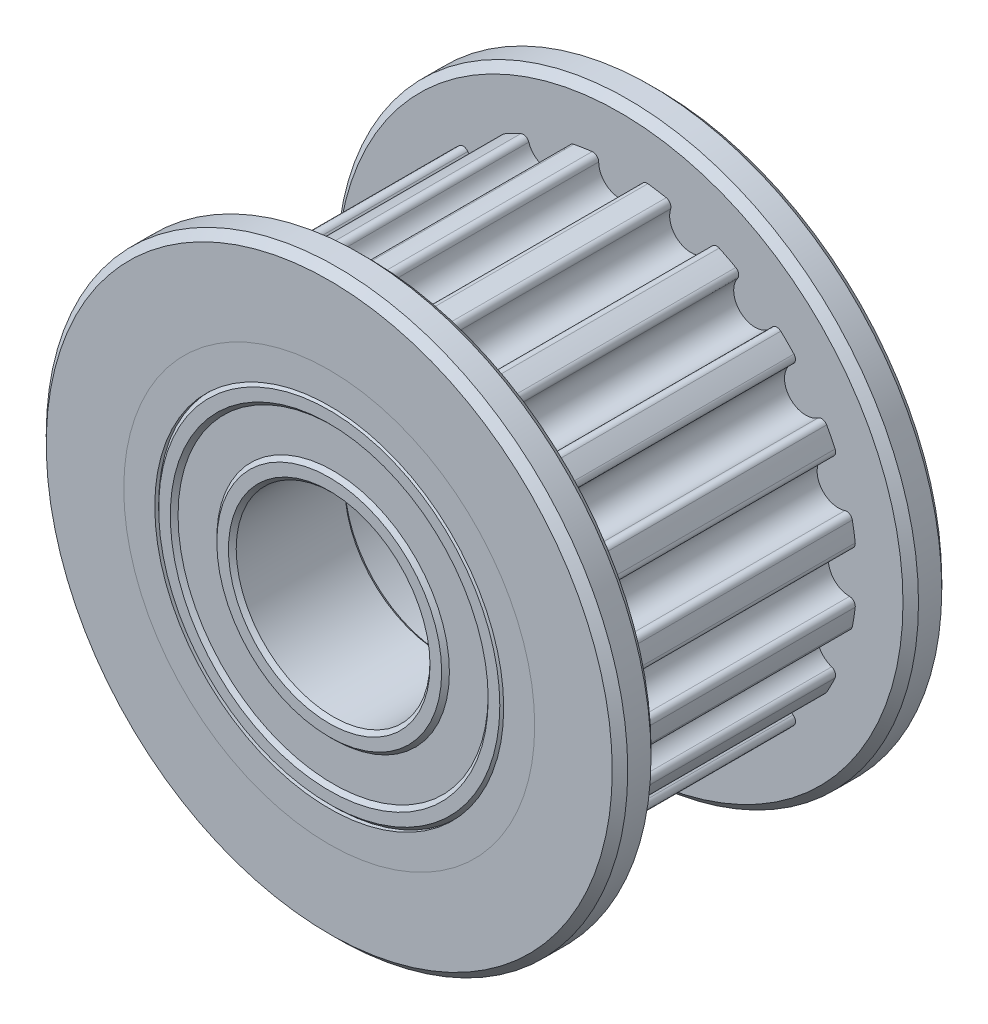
from build123d import *

# Parameters (mm, degrees)
SKICA1_R                  = 5.3
SKICA1_R_2                = 4
P_IDAT_VYSUNUT_M1_DEPTH   = 8.5
SKICA1_3_R                = 7.5
SKICA1_3_R_2              = 5.3
P_IDAT_VYSUNUT_M2_DEPTH   = 1
SKICA2_R                  = 4.75
P_IDAT_VYSUNUT_M5_DEPTH   = 6.5
SKICA4_R                  = 7.5
SKICA4_R_2                = 5.3
P_IDAT_VYSUNUT_M6_DEPTH   = 1
SKICA5_R                  = 4.5
ODEBRAT_VYSUNUT_M3_DEPTH  = 3
ODEBRAT_START             = -3
SKICA6_R                  = 4.5
ODEBRAT_VYSUNUT_M4_DEPTH  = 3
ZKOSEN_1_SIZE             = 0.2
ZKOSEN_2_SIZE             = 0.2
SKICA7_R                  = 4.5
SKICA7_R_2                = 4
P_IDAT_VYSUNUT_M7_DEPTH   = 3
SKICA7_R_3                = 3
SKICA7_R_4                = 2.5
P_IDAT_VYSUNUT_M7_2_DEPTH = 3
P_IDAT_START              = 0.1
SKICA7_3_R                = 4
SKICA7_3_R_2              = 3
P_IDAT_VYSUNUT_M8_DEPTH   = 2.8
ZKOSEN_3_SIZE             = 0.1
ZKOSEN_4_SIZE             = 0.1
SKICA8_R                  = 4.5
SKICA8_R_2                = 4
P_IDAT_VYSUNUT_M9_DEPTH   = 3
SKICA8_R_3                = 3
SKICA8_R_4                = 2.5
P_IDAT_VYSUNUT_M9_2_DEPTH = 3
SKICA8_3_R                = 4
SKICA8_3_R_2              = 3
P_IDAT_VYSUNUT_M10_DEPTH  = 2.8
ZKOSEN_5_SIZE             = 0.1
ZKOSEN_6_SIZE             = 0.1
ZKOSEN_7_SIZE             = 0.1
ZKOSEN_8_SIZE             = 0.1
ZKOSEN_10_SIZE            = 0.1
ZKOSEN_12_SIZE            = 0.1


with BuildPart() as part:
    # Skica1 → P_idat vysunut_m1 (new body)
    with BuildSketch(Plane.XY):
        Circle(SKICA1_R)
        Circle(SKICA1_R_2, mode=Mode.SUBTRACT)
    extrude(amount=P_IDAT_VYSUNUT_M1_DEPTH)

    # Skica5 → Odebrat vysunut_m3 (cut)
    with BuildSketch(Plane.XY.offset(8.5)):
        Circle(SKICA5_R)
    extrude(amount=-ODEBRAT_VYSUNUT_M3_DEPTH, mode=Mode.SUBTRACT)

    # Skica6 → Odebrat vysunut_m4 (cut)
    with BuildSketch(Plane(origin=(0, 0, 0), x_dir=(-1, 0, 0), z_dir=(0, 0, -1)).offset(ODEBRAT_START)):
        with Locations(Location((0, 0, 0), (0, 0, 180))):
            Circle(SKICA6_R)
    extrude(amount=ODEBRAT_VYSUNUT_M4_DEPTH, mode=Mode.SUBTRACT)


with BuildPart() as body_2:
    # Skica1_3 → P_idat vysunut_m2 (new body)
    with BuildSketch(Plane.XY):
        Circle(SKICA1_3_R)
        Circle(SKICA1_3_R_2, mode=Mode.SUBTRACT)
    extrude(amount=P_IDAT_VYSUNUT_M2_DEPTH)

    # Zkosen_1
    zkosen_1_edges = [body_2.edges().sort_by_distance(p)[0] for p in [
        (-7.5, 0, 1),
        (-7.5, 0, 0),
    ]]
    chamfer(zkosen_1_edges, length=ZKOSEN_1_SIZE)


with BuildPart() as body_3:
    # Skica2 → P_idat vysunut_m5 (new body)
    with BuildSketch(Plane.XY.offset(1)):
        with BuildLine():
            ThreePointArc((-5.920091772, -0.549978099), (-5.375, 0), (-5.920091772, 0.549978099))
            ThreePointArc((-5.920091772, 0.549978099), (-6.031318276, 0.60083033), (-6.067715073, 0.717588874))
            ThreePointArc((-6.067715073, 0.717588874), (-6.034775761, 0.955814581), (-5.992487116, 1.1925595))
            ThreePointArc((-5.992487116, 1.1925595), (-5.921791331, 1.292356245), (-5.800294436, 1.306348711))
            ThreePointArc((-5.800294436, 1.306348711), (-5.111928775, 1.660966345), (-5.460389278, 2.352469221))
            ThreePointArc((-5.460389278, 2.352469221), (-5.550457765, 2.435203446), (-5.548992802, 2.557494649))
            ThreePointArc((-5.548992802, 2.557494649), (-5.444049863, 2.773881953), (-5.330672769, 2.985971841))
            ThreePointArc((-5.330672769, 2.985971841), (-5.232598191, 3.059037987), (-5.112723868, 3.034801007))
            ThreePointArc((-5.112723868, 3.034801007), (-4.348466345, 3.159345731), (-4.466185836, 3.924684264))
            ThreePointArc((-4.466185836, 3.924684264), (-4.526279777, 4.031201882), (-4.487096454, 4.147055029))
            ThreePointArc((-4.487096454, 4.147055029), (-4.320422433, 4.320422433), (-4.147055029, 4.487096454))
            ThreePointArc((-4.147055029, 4.487096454), (-4.031201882, 4.526279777), (-3.924684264, 4.466185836))
            ThreePointArc((-3.924684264, 4.466185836), (-3.159345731, 4.348466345), (-3.034801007, 5.112723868))
            ThreePointArc((-3.034801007, 5.112723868), (-3.059037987, 5.232598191), (-2.985971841, 5.330672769))
            ThreePointArc((-2.985971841, 5.330672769), (-2.773881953, 5.444049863), (-2.557494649, 5.548992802))
            ThreePointArc((-2.557494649, 5.548992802), (-2.435203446, 5.550457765), (-2.352469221, 5.460389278))
            ThreePointArc((-2.352469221, 5.460389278), (-1.660966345, 5.111928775), (-1.306348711, 5.800294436))
            ThreePointArc((-1.306348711, 5.800294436), (-1.292356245, 5.921791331), (-1.1925595, 5.992487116))
            ThreePointArc((-1.1925595, 5.992487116), (-0.955814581, 6.034775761), (-0.717588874, 6.067715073))
            ThreePointArc((-0.717588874, 6.067715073), (-0.60083033, 6.031318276), (-0.549978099, 5.920091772))
            ThreePointArc((-0.549978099, 5.920091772), (0, 5.375), (0.549978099, 5.920091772))
            ThreePointArc((0.549978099, 5.920091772), (0.60083033, 6.031318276), (0.717588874, 6.067715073))
            ThreePointArc((0.717588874, 6.067715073), (0.955814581, 6.034775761), (1.1925595, 5.992487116))
            ThreePointArc((1.1925595, 5.992487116), (1.292356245, 5.921791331), (1.306348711, 5.800294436))
            ThreePointArc((1.306348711, 5.800294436), (1.660966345, 5.111928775), (2.352469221, 5.460389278))
            ThreePointArc((2.352469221, 5.460389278), (2.435203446, 5.550457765), (2.557494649, 5.548992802))
            ThreePointArc((2.557494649, 5.548992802), (2.773881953, 5.444049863), (2.985971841, 5.330672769))
            ThreePointArc((2.985971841, 5.330672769), (3.059037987, 5.232598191), (3.034801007, 5.112723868))
            ThreePointArc((3.034801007, 5.112723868), (3.159345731, 4.348466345), (3.924684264, 4.466185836))
            ThreePointArc((3.924684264, 4.466185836), (4.031201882, 4.526279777), (4.147055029, 4.487096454))
            ThreePointArc((4.147055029, 4.487096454), (4.320422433, 4.320422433), (4.487096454, 4.147055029))
            ThreePointArc((4.487096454, 4.147055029), (4.526279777, 4.031201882), (4.466185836, 3.924684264))
            ThreePointArc((4.466185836, 3.924684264), (4.348466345, 3.159345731), (5.112723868, 3.034801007))
            ThreePointArc((5.112723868, 3.034801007), (5.232598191, 3.059037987), (5.330672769, 2.985971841))
            ThreePointArc((5.330672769, 2.985971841), (5.444049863, 2.773881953), (5.548992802, 2.557494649))
            ThreePointArc((5.548992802, 2.557494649), (5.550457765, 2.435203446), (5.460389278, 2.352469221))
            ThreePointArc((5.460389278, 2.352469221), (5.111928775, 1.660966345), (5.800294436, 1.306348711))
            ThreePointArc((5.800294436, 1.306348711), (5.921791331, 1.292356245), (5.992487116, 1.1925595))
            ThreePointArc((5.992487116, 1.1925595), (6.034775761, 0.955814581), (6.067715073, 0.717588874))
            ThreePointArc((6.067715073, 0.717588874), (6.031318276, 0.60083033), (5.920091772, 0.549978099))
            ThreePointArc((5.920091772, 0.549978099), (5.375, 0), (5.920091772, -0.549978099))
            ThreePointArc((5.920091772, -0.549978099), (6.031318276, -0.60083033), (6.067715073, -0.717588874))
            ThreePointArc((6.067715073, -0.717588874), (6.034775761, -0.955814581), (5.992487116, -1.1925595))
            ThreePointArc((5.992487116, -1.1925595), (5.921791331, -1.292356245), (5.800294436, -1.306348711))
            ThreePointArc((5.800294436, -1.306348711), (5.111928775, -1.660966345), (5.460389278, -2.352469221))
            ThreePointArc((5.460389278, -2.352469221), (5.550457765, -2.435203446), (5.548992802, -2.557494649))
            ThreePointArc((5.548992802, -2.557494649), (5.444049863, -2.773881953), (5.330672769, -2.985971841))
            ThreePointArc((5.330672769, -2.985971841), (5.232598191, -3.059037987), (5.112723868, -3.034801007))
            ThreePointArc((5.112723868, -3.034801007), (4.348466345, -3.159345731), (4.466185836, -3.924684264))
            ThreePointArc((4.466185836, -3.924684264), (4.526279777, -4.031201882), (4.487096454, -4.147055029))
            ThreePointArc((4.487096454, -4.147055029), (4.320422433, -4.320422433), (4.147055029, -4.487096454))
            ThreePointArc((4.147055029, -4.487096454), (4.031201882, -4.526279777), (3.924684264, -4.466185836))
            ThreePointArc((3.924684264, -4.466185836), (3.159345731, -4.348466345), (3.034801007, -5.112723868))
            ThreePointArc((3.034801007, -5.112723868), (3.059037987, -5.232598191), (2.985971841, -5.330672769))
            ThreePointArc((2.985971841, -5.330672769), (2.773881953, -5.444049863), (2.557494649, -5.548992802))
            ThreePointArc((2.557494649, -5.548992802), (2.435203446, -5.550457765), (2.352469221, -5.460389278))
            ThreePointArc((2.352469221, -5.460389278), (1.660966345, -5.111928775), (1.306348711, -5.800294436))
            ThreePointArc((1.306348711, -5.800294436), (1.292356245, -5.921791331), (1.1925595, -5.992487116))
            ThreePointArc((1.1925595, -5.992487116), (0.955814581, -6.034775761), (0.717588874, -6.067715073))
            ThreePointArc((0.717588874, -6.067715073), (0.60083033, -6.031318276), (0.549978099, -5.920091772))
            ThreePointArc((0.549978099, -5.920091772), (0, -5.375), (-0.549978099, -5.920091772))
            ThreePointArc((-0.549978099, -5.920091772), (-0.60083033, -6.031318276), (-0.717588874, -6.067715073))
            ThreePointArc((-0.717588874, -6.067715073), (-0.955814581, -6.034775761), (-1.1925595, -5.992487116))
            ThreePointArc((-1.1925595, -5.992487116), (-1.292356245, -5.921791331), (-1.306348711, -5.800294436))
            ThreePointArc((-1.306348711, -5.800294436), (-1.660966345, -5.111928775), (-2.352469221, -5.460389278))
            ThreePointArc((-2.352469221, -5.460389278), (-2.435203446, -5.550457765), (-2.557494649, -5.548992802))
            ThreePointArc((-2.557494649, -5.548992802), (-2.773881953, -5.444049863), (-2.985971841, -5.330672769))
            ThreePointArc((-2.985971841, -5.330672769), (-3.059037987, -5.232598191), (-3.034801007, -5.112723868))
            ThreePointArc((-3.034801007, -5.112723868), (-3.159345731, -4.348466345), (-3.924684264, -4.466185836))
            ThreePointArc((-3.924684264, -4.466185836), (-4.031201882, -4.526279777), (-4.147055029, -4.487096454))
            ThreePointArc((-4.147055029, -4.487096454), (-4.320422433, -4.320422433), (-4.487096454, -4.147055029))
            ThreePointArc((-4.487096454, -4.147055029), (-4.526279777, -4.031201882), (-4.466185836, -3.924684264))
            ThreePointArc((-4.466185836, -3.924684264), (-4.348466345, -3.159345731), (-5.112723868, -3.034801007))
            ThreePointArc((-5.112723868, -3.034801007), (-5.232598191, -3.059037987), (-5.330672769, -2.985971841))
            ThreePointArc((-5.330672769, -2.985971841), (-5.444049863, -2.773881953), (-5.548992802, -2.557494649))
            ThreePointArc((-5.548992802, -2.557494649), (-5.550457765, -2.435203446), (-5.460389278, -2.352469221))
            ThreePointArc((-5.460389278, -2.352469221), (-5.111928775, -1.660966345), (-5.800294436, -1.306348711))
            ThreePointArc((-5.800294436, -1.306348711), (-5.921791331, -1.292356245), (-5.992487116, -1.1925595))
            ThreePointArc((-5.992487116, -1.1925595), (-6.034775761, -0.955814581), (-6.067715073, -0.717588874))
            ThreePointArc((-6.067715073, -0.717588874), (-6.031318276, -0.60083033), (-5.920091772, -0.549978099))
        make_face()
        with Locations(Location((0, 0, 0), (0, 0, 180))):
            Circle(SKICA2_R, mode=Mode.SUBTRACT)
    extrude(amount=P_IDAT_VYSUNUT_M5_DEPTH)


with BuildPart() as body_4:
    # Skica4 → P_idat vysunut_m6 (new body)
    with BuildSketch(Plane.XY.offset(7.5)):
        Circle(SKICA4_R)
        Circle(SKICA4_R_2, mode=Mode.SUBTRACT)
    extrude(amount=P_IDAT_VYSUNUT_M6_DEPTH)

    # Zkosen_2
    zkosen_2_edges = [body_4.edges().sort_by_distance(p)[0] for p in [
        (-7.5, 0, 7.5),
        (-7.5, 0, 8.5),
    ]]
    chamfer(zkosen_2_edges, length=ZKOSEN_2_SIZE)


with BuildPart() as body_5:
    # Skica7 → P_idat vysunut_m7 (new body)
    with BuildSketch(Plane(origin=(0, 0, 3), x_dir=(-1, 0, 0), z_dir=(0, 0, -1))):
        Circle(SKICA7_R)
        Circle(SKICA7_R_2, mode=Mode.SUBTRACT)
    extrude(amount=P_IDAT_VYSUNUT_M7_DEPTH)

    # Zkosen_3
    zkosen_3_edges = [body_5.edges().sort_by_distance(p)[0] for p in [
        (4, 0, 0),
        (4.5, 0, 0),
    ]]
    chamfer(zkosen_3_edges, length=ZKOSEN_3_SIZE)

    # Zkosen_12
    zkosen_12_edges = [body_5.edges().sort_by_distance(p)[0] for p in [
        (4, 0, 3),
        (4.5, 0, 3),
    ]]
    chamfer(zkosen_12_edges, length=ZKOSEN_12_SIZE)


with BuildPart() as body_6:
    # Skica7 → P_idat vysunut_m7 2 (new body)
    with BuildSketch(Plane(origin=(0, 0, 3), x_dir=(-1, 0, 0), z_dir=(0, 0, -1))):
        Circle(SKICA7_R_3)
        Circle(SKICA7_R_4, mode=Mode.SUBTRACT)
    extrude(amount=P_IDAT_VYSUNUT_M7_2_DEPTH)

    # Zkosen_4
    zkosen_4_edges = [body_6.edges().sort_by_distance(p)[0] for p in [
        (2.5, 0, 0),
        (3, 0, 0),
    ]]
    chamfer(zkosen_4_edges, length=ZKOSEN_4_SIZE)

    # Zkosen_10
    zkosen_10_edges = [body_6.edges().sort_by_distance(p)[0] for p in [
        (3, 0, 3),
        (2.5, 0, 3),
    ]]
    chamfer(zkosen_10_edges, length=ZKOSEN_10_SIZE)


with BuildPart() as body_7:
    # Skica7_3 → P_idat vysunut_m8 (new body)
    with BuildSketch(Plane(origin=(0, 0, 3), x_dir=(-1, 0, 0), z_dir=(0, 0, -1)).offset(P_IDAT_START)):
        Circle(SKICA7_3_R)
        Circle(SKICA7_3_R_2, mode=Mode.SUBTRACT)
    extrude(amount=P_IDAT_VYSUNUT_M8_DEPTH)


with BuildPart() as body_8:
    # Skica8 → P_idat vysunut_m9 (new body)
    with BuildSketch(Plane.XY.offset(5.5)):
        Circle(SKICA8_R)
        Circle(SKICA8_R_2, mode=Mode.SUBTRACT)
    extrude(amount=P_IDAT_VYSUNUT_M9_DEPTH)

    # Zkosen_5
    zkosen_5_edges = [body_8.edges().sort_by_distance(p)[0] for p in [
        (-4, 0, 8.5),
        (-4.5, 0, 8.5),
    ]]
    chamfer(zkosen_5_edges, length=ZKOSEN_5_SIZE)

    # Zkosen_8
    zkosen_8_edges = [body_8.edges().sort_by_distance(p)[0] for p in [
        (-4, 0, 5.5),
        (-4.5, 0, 5.5),
    ]]
    chamfer(zkosen_8_edges, length=ZKOSEN_8_SIZE)


with BuildPart() as body_9:
    # Skica8 → P_idat vysunut_m9 2 (new body)
    with BuildSketch(Plane.XY.offset(5.5)):
        Circle(SKICA8_R_3)
        Circle(SKICA8_R_4, mode=Mode.SUBTRACT)
    extrude(amount=P_IDAT_VYSUNUT_M9_2_DEPTH)

    # Zkosen_6
    zkosen_6_edges = [body_9.edges().sort_by_distance(p)[0] for p in [
        (-2.5, 0, 8.5),
        (-3, 0, 8.5),
    ]]
    chamfer(zkosen_6_edges, length=ZKOSEN_6_SIZE)

    # Zkosen_7
    zkosen_7_edges = [body_9.edges().sort_by_distance(p)[0] for p in [
        (-3, 0, 5.5),
        (-2.5, 0, 5.5),
    ]]
    chamfer(zkosen_7_edges, length=ZKOSEN_7_SIZE)


with BuildPart() as body_10:
    # Skica8_3 → P_idat vysunut_m10 (new body)
    with BuildSketch(Plane.XY.offset(5.5).offset(P_IDAT_START)):
        Circle(SKICA8_3_R)
        Circle(SKICA8_3_R_2, mode=Mode.SUBTRACT)
    extrude(amount=P_IDAT_VYSUNUT_M10_DEPTH)


solid = Compound([part.part, body_2.part, body_3.part, body_4.part, body_5.part, body_6.part, body_7.part, body_8.part, body_9.part, body_10.part])
